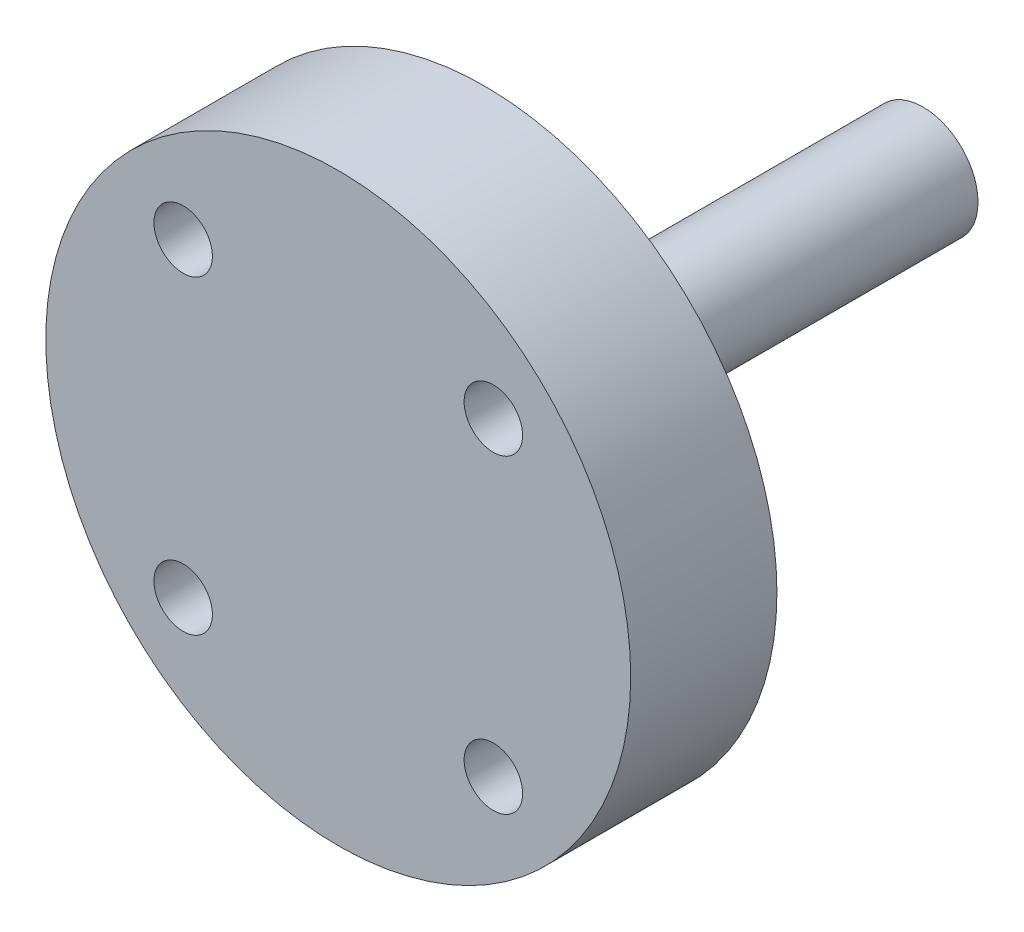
ISO-10303-21;
HEADER;
FILE_DESCRIPTION(('STEP AP214'),'2;1');
FILE_NAME('part.step','',(''),(''),'','','');
FILE_SCHEMA(('AUTOMOTIVE_DESIGN { 1 0 10303 214 1 1 1 1 }'));
ENDSEC;
DATA;
#1=APPLICATION_CONTEXT('core data for automotive mechanical design processes');
#2=APPLICATION_PROTOCOL_DEFINITION('international standard','automotive_design',2000,#1);
#3=PRODUCT_CONTEXT('',#1,'mechanical');
#4=PRODUCT('Part','Part','',(#3));
#5=PRODUCT_RELATED_PRODUCT_CATEGORY('part','',(#4));
#6=PRODUCT_DEFINITION_FORMATION('','',#4);
#7=PRODUCT_DEFINITION_CONTEXT('part definition',#1,'design');
#8=PRODUCT_DEFINITION('design','',#6,#7);
#9=PRODUCT_DEFINITION_SHAPE('','',#8);
#10=(LENGTH_UNIT() NAMED_UNIT(*) SI_UNIT(.MILLI.,.METRE.));
#11=(NAMED_UNIT(*) PLANE_ANGLE_UNIT() SI_UNIT($,.RADIAN.));
#12=(NAMED_UNIT(*) SI_UNIT($,.STERADIAN.) SOLID_ANGLE_UNIT());
#13=UNCERTAINTY_MEASURE_WITH_UNIT(LENGTH_MEASURE(1.E-05),#10,'distance_accuracy_value','');
#14=(GEOMETRIC_REPRESENTATION_CONTEXT(3) GLOBAL_UNCERTAINTY_ASSIGNED_CONTEXT((#13)) GLOBAL_UNIT_ASSIGNED_CONTEXT((#10,
#11,#12)) REPRESENTATION_CONTEXT('',''));
#15=CARTESIAN_POINT('',(0.,0.,0.));
#16=DIRECTION('',(0.,0.,1.));
#17=DIRECTION('',(1.,0.,0.));
#18=AXIS2_PLACEMENT_3D('',#15,#16,#17);
#19=CARTESIAN_POINT('',(0.,0.,60.));
#20=DIRECTION('',(0.,0.,-1.));
#21=DIRECTION('',(-1.,0.,0.));
#22=AXIS2_PLACEMENT_3D('',#19,#20,#21);
#23=CYLINDRICAL_SURFACE('',#22,7.5);
#24=CARTESIAN_POINT('',(0.,0.,60.));
#25=DIRECTION('',(0.,0.,1.));
#26=DIRECTION('',(1.,0.,0.));
#27=AXIS2_PLACEMENT_3D('',#24,#25,#26);
#28=CIRCLE('',#27,7.5);
#29=CARTESIAN_POINT('',(7.5,0.,60.));
#30=VERTEX_POINT('',#29);
#31=EDGE_CURVE('E10',#30,#30,#28,.T.);
#32=ORIENTED_EDGE('',*,*,#31,.F.);
#33=EDGE_LOOP('',(#32));
#34=FACE_BOUND('',#33,.T.);
#35=CARTESIAN_POINT('',(0.,0.,0.));
#36=DIRECTION('',(0.,0.,1.));
#37=DIRECTION('',(1.,0.,0.));
#38=AXIS2_PLACEMENT_3D('',#35,#36,#37);
#39=CIRCLE('',#38,7.5);
#40=CARTESIAN_POINT('',(7.5,0.,0.));
#41=VERTEX_POINT('',#40);
#42=EDGE_CURVE('E28',#41,#41,#39,.T.);
#43=ORIENTED_EDGE('',*,*,#42,.T.);
#44=EDGE_LOOP('',(#43));
#45=FACE_BOUND('',#44,.T.);
#46=ADVANCED_FACE('F22',(#34,#45),#23,.T.);
#47=CARTESIAN_POINT('',(0.,0.,0.));
#48=DIRECTION('',(0.,0.,1.));
#49=DIRECTION('',(1.,0.,0.));
#50=AXIS2_PLACEMENT_3D('',#47,#48,#49);
#51=PLANE('',#50);
#52=ORIENTED_EDGE('',*,*,#42,.F.);
#53=EDGE_LOOP('',(#52));
#54=FACE_BOUND('',#53,.T.);
#55=ADVANCED_FACE('F90',(#54),#51,.F.);
#56=CARTESIAN_POINT('',(0.,0.,60.));
#57=DIRECTION('',(0.,0.,1.));
#58=DIRECTION('',(1.,0.,0.));
#59=AXIS2_PLACEMENT_3D('',#56,#57,#58);
#60=PLANE('',#59);
#61=CARTESIAN_POINT('',(-21.2132034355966,-21.2132034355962,60.));
#62=DIRECTION('',(0.,0.,1.));
#63=DIRECTION('',(1.,0.,0.));
#64=AXIS2_PLACEMENT_3D('',#61,#62,#63);
#65=CIRCLE('',#64,4.);
#66=CARTESIAN_POINT('',(-17.2132034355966,-21.2132034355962,60.));
#67=VERTEX_POINT('',#66);
#68=EDGE_CURVE('E59',#67,#67,#65,.T.);
#69=ORIENTED_EDGE('',*,*,#68,.T.);
#70=EDGE_LOOP('',(#69));
#71=FACE_BOUND('',#70,.T.);
#72=CARTESIAN_POINT('',(21.2132034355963,-21.2132034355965,60.));
#73=DIRECTION('',(0.,0.,1.));
#74=DIRECTION('',(1.,0.,0.));
#75=AXIS2_PLACEMENT_3D('',#72,#73,#74);
#76=CIRCLE('',#75,4.);
#77=CARTESIAN_POINT('',(25.2132034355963,-21.2132034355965,60.));
#78=VERTEX_POINT('',#77);
#79=EDGE_CURVE('E53',#78,#78,#76,.T.);
#80=ORIENTED_EDGE('',*,*,#79,.T.);
#81=EDGE_LOOP('',(#80));
#82=FACE_BOUND('',#81,.T.);
#83=CARTESIAN_POINT('',(21.2132034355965,21.2132034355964,60.));
#84=DIRECTION('',(0.,0.,1.));
#85=DIRECTION('',(1.,0.,0.));
#86=AXIS2_PLACEMENT_3D('',#83,#84,#85);
#87=CIRCLE('',#86,4.);
#88=CARTESIAN_POINT('',(25.2132034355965,21.2132034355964,60.));
#89=VERTEX_POINT('',#88);
#90=EDGE_CURVE('E47',#89,#89,#87,.T.);
#91=ORIENTED_EDGE('',*,*,#90,.T.);
#92=EDGE_LOOP('',(#91));
#93=FACE_BOUND('',#92,.T.);
#94=CARTESIAN_POINT('',(-21.2132034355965,21.2132034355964,60.));
#95=DIRECTION('',(0.,0.,1.));
#96=DIRECTION('',(1.,0.,0.));
#97=AXIS2_PLACEMENT_3D('',#94,#95,#96);
#98=CIRCLE('',#97,4.);
#99=CARTESIAN_POINT('',(-17.2132034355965,21.2132034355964,60.));
#100=VERTEX_POINT('',#99);
#101=EDGE_CURVE('E41',#100,#100,#98,.T.);
#102=ORIENTED_EDGE('',*,*,#101,.T.);
#103=EDGE_LOOP('',(#102));
#104=FACE_BOUND('',#103,.T.);
#105=CARTESIAN_POINT('',(0.,0.,60.));
#106=DIRECTION('',(0.,0.,1.));
#107=DIRECTION('',(1.,0.,0.));
#108=AXIS2_PLACEMENT_3D('',#105,#106,#107);
#109=CIRCLE('',#108,40.);
#110=CARTESIAN_POINT('',(40.,0.,60.));
#111=VERTEX_POINT('',#110);
#112=EDGE_CURVE('E36',#111,#111,#109,.T.);
#113=ORIENTED_EDGE('',*,*,#112,.F.);
#114=EDGE_LOOP('',(#113));
#115=FACE_BOUND('',#114,.T.);
#116=ORIENTED_EDGE('',*,*,#31,.T.);
#117=EDGE_LOOP('',(#116));
#118=FACE_BOUND('',#117,.T.);
#119=ADVANCED_FACE('F85',(#71,#82,#93,#104,#115,#118),#60,.F.);
#120=CARTESIAN_POINT('',(0.,0.,80.));
#121=DIRECTION('',(0.,0.,-1.));
#122=DIRECTION('',(-1.,0.,0.));
#123=AXIS2_PLACEMENT_3D('',#120,#121,#122);
#124=CYLINDRICAL_SURFACE('',#123,40.);
#125=CARTESIAN_POINT('',(0.,0.,80.));
#126=DIRECTION('',(0.,0.,1.));
#127=DIRECTION('',(1.,0.,0.));
#128=AXIS2_PLACEMENT_3D('',#125,#126,#127);
#129=CIRCLE('',#128,40.);
#130=CARTESIAN_POINT('',(40.,0.,80.));
#131=VERTEX_POINT('',#130);
#132=EDGE_CURVE('E32',#131,#131,#129,.T.);
#133=ORIENTED_EDGE('',*,*,#132,.F.);
#134=EDGE_LOOP('',(#133));
#135=FACE_BOUND('',#134,.T.);
#136=ORIENTED_EDGE('',*,*,#112,.T.);
#137=EDGE_LOOP('',(#136));
#138=FACE_BOUND('',#137,.T.);
#139=ADVANCED_FACE('F73',(#135,#138),#124,.T.);
#140=CARTESIAN_POINT('',(0.,0.,80.));
#141=DIRECTION('',(0.,0.,1.));
#142=DIRECTION('',(1.,0.,0.));
#143=AXIS2_PLACEMENT_3D('',#140,#141,#142);
#144=PLANE('',#143);
#145=CARTESIAN_POINT('',(-21.2132034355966,-21.2132034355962,80.));
#146=DIRECTION('',(0.,0.,1.));
#147=DIRECTION('',(0.,1.,0.));
#148=AXIS2_PLACEMENT_3D('',#145,#146,#147);
#149=CIRCLE('',#148,4.);
#150=CARTESIAN_POINT('',(-21.2132034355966,-17.2132034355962,80.));
#151=VERTEX_POINT('',#150);
#152=EDGE_CURVE('E62',#151,#151,#149,.T.);
#153=ORIENTED_EDGE('',*,*,#152,.F.);
#154=EDGE_LOOP('',(#153));
#155=FACE_BOUND('',#154,.T.);
#156=CARTESIAN_POINT('',(21.2132034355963,-21.2132034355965,80.));
#157=DIRECTION('',(0.,0.,1.));
#158=DIRECTION('',(-1.,0.,0.));
#159=AXIS2_PLACEMENT_3D('',#156,#157,#158);
#160=CIRCLE('',#159,4.);
#161=CARTESIAN_POINT('',(17.2132034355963,-21.2132034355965,80.));
#162=VERTEX_POINT('',#161);
#163=EDGE_CURVE('E56',#162,#162,#160,.T.);
#164=ORIENTED_EDGE('',*,*,#163,.F.);
#165=EDGE_LOOP('',(#164));
#166=FACE_BOUND('',#165,.T.);
#167=CARTESIAN_POINT('',(21.2132034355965,21.2132034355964,80.));
#168=DIRECTION('',(0.,0.,1.));
#169=DIRECTION('',(0.,-1.,0.));
#170=AXIS2_PLACEMENT_3D('',#167,#168,#169);
#171=CIRCLE('',#170,4.);
#172=CARTESIAN_POINT('',(21.2132034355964,17.2132034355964,80.));
#173=VERTEX_POINT('',#172);
#174=EDGE_CURVE('E50',#173,#173,#171,.T.);
#175=ORIENTED_EDGE('',*,*,#174,.F.);
#176=EDGE_LOOP('',(#175));
#177=FACE_BOUND('',#176,.T.);
#178=CARTESIAN_POINT('',(-21.2132034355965,21.2132034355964,80.));
#179=DIRECTION('',(0.,0.,1.));
#180=DIRECTION('',(1.,0.,0.));
#181=AXIS2_PLACEMENT_3D('',#178,#179,#180);
#182=CIRCLE('',#181,4.);
#183=CARTESIAN_POINT('',(-17.2132034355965,21.2132034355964,80.));
#184=VERTEX_POINT('',#183);
#185=EDGE_CURVE('E44',#184,#184,#182,.T.);
#186=ORIENTED_EDGE('',*,*,#185,.F.);
#187=EDGE_LOOP('',(#186));
#188=FACE_BOUND('',#187,.T.);
#189=ORIENTED_EDGE('',*,*,#132,.T.);
#190=EDGE_LOOP('',(#189));
#191=FACE_BOUND('',#190,.T.);
#192=ADVANCED_FACE('F69',(#155,#166,#177,#188,#191),#144,.T.);
#193=CARTESIAN_POINT('',(-21.2132034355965,21.2132034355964,0.));
#194=DIRECTION('',(0.,0.,1.));
#195=DIRECTION('',(1.,0.,0.));
#196=AXIS2_PLACEMENT_3D('',#193,#194,#195);
#197=CYLINDRICAL_SURFACE('',#196,4.);
#198=ORIENTED_EDGE('',*,*,#185,.T.);
#199=EDGE_LOOP('',(#198));
#200=FACE_BOUND('',#199,.T.);
#201=ORIENTED_EDGE('',*,*,#101,.F.);
#202=EDGE_LOOP('',(#201));
#203=FACE_BOUND('',#202,.T.);
#204=ADVANCED_FACE('F72',(#200,#203),#197,.F.);
#205=CARTESIAN_POINT('',(21.2132034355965,21.2132034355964,0.));
#206=DIRECTION('',(0.,0.,1.));
#207=DIRECTION('',(1.,0.,0.));
#208=AXIS2_PLACEMENT_3D('',#205,#206,#207);
#209=CYLINDRICAL_SURFACE('',#208,4.);
#210=ORIENTED_EDGE('',*,*,#174,.T.);
#211=EDGE_LOOP('',(#210));
#212=FACE_BOUND('',#211,.T.);
#213=ORIENTED_EDGE('',*,*,#90,.F.);
#214=EDGE_LOOP('',(#213));
#215=FACE_BOUND('',#214,.T.);
#216=ADVANCED_FACE('F123',(#212,#215),#209,.F.);
#217=CARTESIAN_POINT('',(21.2132034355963,-21.2132034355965,0.));
#218=DIRECTION('',(0.,0.,1.));
#219=DIRECTION('',(1.,0.,0.));
#220=AXIS2_PLACEMENT_3D('',#217,#218,#219);
#221=CYLINDRICAL_SURFACE('',#220,4.);
#222=ORIENTED_EDGE('',*,*,#163,.T.);
#223=EDGE_LOOP('',(#222));
#224=FACE_BOUND('',#223,.T.);
#225=ORIENTED_EDGE('',*,*,#79,.F.);
#226=EDGE_LOOP('',(#225));
#227=FACE_BOUND('',#226,.T.);
#228=ADVANCED_FACE('F130',(#224,#227),#221,.F.);
#229=CARTESIAN_POINT('',(-21.2132034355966,-21.2132034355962,0.));
#230=DIRECTION('',(0.,0.,1.));
#231=DIRECTION('',(1.,0.,0.));
#232=AXIS2_PLACEMENT_3D('',#229,#230,#231);
#233=CYLINDRICAL_SURFACE('',#232,4.);
#234=ORIENTED_EDGE('',*,*,#152,.T.);
#235=EDGE_LOOP('',(#234));
#236=FACE_BOUND('',#235,.T.);
#237=ORIENTED_EDGE('',*,*,#68,.F.);
#238=EDGE_LOOP('',(#237));
#239=FACE_BOUND('',#238,.T.);
#240=ADVANCED_FACE('F66',(#236,#239),#233,.F.);
#241=CLOSED_SHELL('',(#46,#55,#119,#139,#192,#204,#216,#228,#240));
#242=MANIFOLD_SOLID_BREP('B2',#241);
#243=ADVANCED_BREP_SHAPE_REPRESENTATION('',(#18,#242),#14);
#244=SHAPE_DEFINITION_REPRESENTATION(#9,#243);
ENDSEC;
END-ISO-10303-21;
